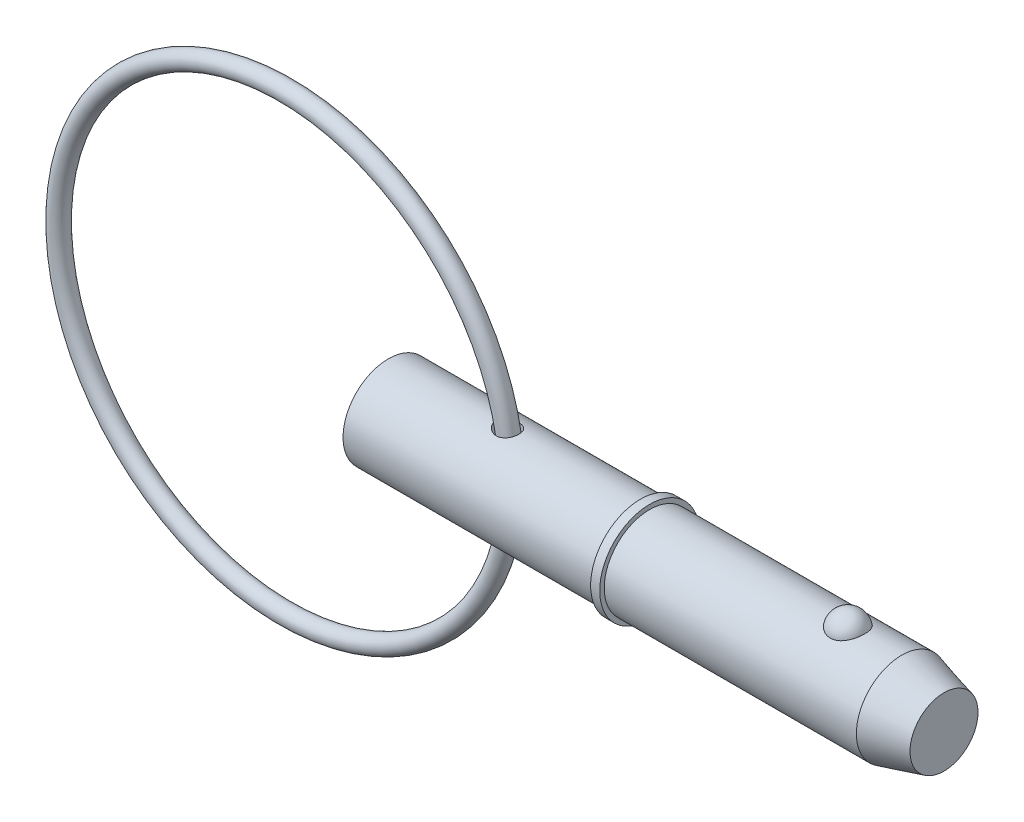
ISO-10303-21;
HEADER;
FILE_DESCRIPTION(('STEP AP214'),'2;1');
FILE_NAME('part.step','',(''),(''),'','','');
FILE_SCHEMA(('AUTOMOTIVE_DESIGN { 1 0 10303 214 1 1 1 1 }'));
ENDSEC;
DATA;
#1=APPLICATION_CONTEXT('core data for automotive mechanical design processes');
#2=APPLICATION_PROTOCOL_DEFINITION('international standard','automotive_design',2000,#1);
#3=PRODUCT_CONTEXT('',#1,'mechanical');
#4=PRODUCT('Part','Part','',(#3));
#5=PRODUCT_RELATED_PRODUCT_CATEGORY('part','',(#4));
#6=PRODUCT_DEFINITION_FORMATION('','',#4);
#7=PRODUCT_DEFINITION_CONTEXT('part definition',#1,'design');
#8=PRODUCT_DEFINITION('design','',#6,#7);
#9=PRODUCT_DEFINITION_SHAPE('','',#8);
#10=(LENGTH_UNIT() NAMED_UNIT(*) SI_UNIT(.MILLI.,.METRE.));
#11=(NAMED_UNIT(*) PLANE_ANGLE_UNIT() SI_UNIT($,.RADIAN.));
#12=(NAMED_UNIT(*) SI_UNIT($,.STERADIAN.) SOLID_ANGLE_UNIT());
#13=UNCERTAINTY_MEASURE_WITH_UNIT(LENGTH_MEASURE(1.E-05),#10,'distance_accuracy_value','');
#14=(GEOMETRIC_REPRESENTATION_CONTEXT(3) GLOBAL_UNCERTAINTY_ASSIGNED_CONTEXT((#13)) GLOBAL_UNIT_ASSIGNED_CONTEXT((#10,
#11,#12)) REPRESENTATION_CONTEXT('',''));
#15=CARTESIAN_POINT('',(0.,0.,0.));
#16=DIRECTION('',(0.,0.,1.));
#17=DIRECTION('',(1.,0.,0.));
#18=AXIS2_PLACEMENT_3D('',#15,#16,#17);
#19=CARTESIAN_POINT('',(-7.21857545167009,0.,0.));
#20=DIRECTION('',(0.,0.,1.));
#21=DIRECTION('',(1.,0.,0.));
#22=AXIS2_PLACEMENT_3D('',#19,#20,#21);
#23=TOROIDAL_SURFACE('',#22,15.875,0.634999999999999);
#24=CARTESIAN_POINT('',(9.29142454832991,0.,0.));
#25=VERTEX_POINT('',#24);
#26=VERTEX_LOOP('',#25);
#27=FACE_BOUND('',#26,.T.);
#28=ADVANCED_FACE('P0_F12',(#27),#23,.T.);
#29=CLOSED_SHELL('',(#28));
#30=MANIFOLD_SOLID_BREP('P0_B1',#29);
#31=CARTESIAN_POINT('',(0.,0.,0.));
#32=DIRECTION('',(1.,0.,0.));
#33=DIRECTION('',(0.,0.,-1.));
#34=AXIS2_PLACEMENT_3D('',#31,#32,#33);
#35=CYLINDRICAL_SURFACE('',#34,3.175);
#36=CARTESIAN_POINT('',(7.61208756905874,3.1556298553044,-0.35017883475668));
#37=CARTESIAN_POINT('',(7.63371620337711,3.15106857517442,-0.391277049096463));
#38=CARTESIAN_POINT('',(7.65900587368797,3.14590738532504,-0.430417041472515));
#39=CARTESIAN_POINT('',(7.71586762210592,3.13499707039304,-0.503788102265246));
#40=CARTESIAN_POINT('',(7.74745045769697,3.12924694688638,-0.538010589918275));
#41=CARTESIAN_POINT('',(7.81573449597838,3.11782384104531,-0.600675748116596));
#42=CARTESIAN_POINT('',(7.85242014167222,3.11215067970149,-0.629135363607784));
#43=CARTESIAN_POINT('',(7.9299616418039,3.10148180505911,-0.679784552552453));
#44=CARTESIAN_POINT('',(7.97081650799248,3.0964859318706,-0.701975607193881));
#45=CARTESIAN_POINT('',(8.05731415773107,3.08756286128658,-0.740259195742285));
#46=CARTESIAN_POINT('',(8.10308043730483,3.08368396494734,-0.756085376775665));
#47=CARTESIAN_POINT('',(8.19675033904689,3.07777545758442,-0.779791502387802));
#48=CARTESIAN_POINT('',(8.24465368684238,3.07574560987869,-0.787672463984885));
#49=CARTESIAN_POINT('',(8.33978659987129,3.07388057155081,-0.794919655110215));
#50=CARTESIAN_POINT('',(8.38699681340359,3.07398484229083,-0.794520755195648));
#51=CARTESIAN_POINT('',(8.48058476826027,3.07628376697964,-0.785572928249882));
#52=CARTESIAN_POINT('',(8.52696281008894,3.07847765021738,-0.777027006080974));
#53=CARTESIAN_POINT('',(8.61487038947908,3.08453758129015,-0.752595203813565));
#54=CARTESIAN_POINT('',(8.65652632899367,3.0883052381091,-0.737137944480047));
#55=CARTESIAN_POINT('',(8.73650065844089,3.09706199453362,-0.69943165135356));
#56=CARTESIAN_POINT('',(8.77481931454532,3.10205099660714,-0.677183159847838));
#57=CARTESIAN_POINT('',(8.84638246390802,3.11258194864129,-0.62697851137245));
#58=CARTESIAN_POINT('',(8.87970556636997,3.11811239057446,-0.599131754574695));
#59=CARTESIAN_POINT('',(8.94123162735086,3.12919300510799,-0.538266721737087));
#60=CARTESIAN_POINT('',(8.96943428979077,3.1347431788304,-0.505248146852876));
#61=CARTESIAN_POINT('',(9.02036334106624,3.14533698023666,-0.434482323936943));
#62=CARTESIAN_POINT('',(9.04301290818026,3.15037299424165,-0.396678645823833));
#63=CARTESIAN_POINT('',(9.08180072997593,3.15931021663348,-0.317742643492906));
#64=CARTESIAN_POINT('',(9.0979387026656,3.1632113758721,-0.27661017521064));
#65=CARTESIAN_POINT('',(9.12343544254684,3.16949230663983,-0.191753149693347));
#66=CARTESIAN_POINT('',(9.13272827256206,3.17185725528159,-0.148007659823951));
#67=CARTESIAN_POINT('',(9.14405176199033,3.17475043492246,-0.0595274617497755));
#68=CARTESIAN_POINT('',(9.14608246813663,3.17527867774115,-0.0147927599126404));
#69=CARTESIAN_POINT('',(9.1428335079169,3.1744420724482,0.0743443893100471));
#70=CARTESIAN_POINT('',(9.13756166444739,3.17307925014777,0.118747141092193));
#71=CARTESIAN_POINT('',(9.11985162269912,3.1686108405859,0.206009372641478));
#72=CARTESIAN_POINT('',(9.10741326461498,3.16550521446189,0.248868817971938));
#73=CARTESIAN_POINT('',(9.07566875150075,3.1578851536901,0.331849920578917));
#74=CARTESIAN_POINT('',(9.05635986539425,3.15337015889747,0.371970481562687));
#75=CARTESIAN_POINT('',(9.01134716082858,3.14342392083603,0.448324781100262));
#76=CARTESIAN_POINT('',(8.98564319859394,3.13799265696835,0.484558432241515));
#77=CARTESIAN_POINT('',(8.92847529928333,3.12681455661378,0.552114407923));
#78=CARTESIAN_POINT('',(8.89701024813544,3.12106765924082,0.583435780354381));
#79=CARTESIAN_POINT('',(8.82914631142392,3.10991074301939,0.640250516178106));
#80=CARTESIAN_POINT('',(8.79274799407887,3.10450068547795,0.665744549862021));
#81=CARTESIAN_POINT('',(8.71647895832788,3.09469918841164,0.709908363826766));
#82=CARTESIAN_POINT('',(8.6766541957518,3.09029650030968,0.728654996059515));
#83=CARTESIAN_POINT('',(8.59431583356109,3.08292493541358,0.759241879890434));
#84=CARTESIAN_POINT('',(8.55180254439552,3.07995589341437,0.771082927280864));
#85=CARTESIAN_POINT('',(8.46578539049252,3.07578939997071,0.787538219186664));
#86=CARTESIAN_POINT('',(8.42229655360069,3.07457372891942,0.792226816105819));
#87=CARTESIAN_POINT('',(8.33511786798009,3.07395008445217,0.794642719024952));
#88=CARTESIAN_POINT('',(8.29142799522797,3.07454233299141,0.792369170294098));
#89=CARTESIAN_POINT('',(8.20393675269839,3.07746038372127,0.7809593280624));
#90=CARTESIAN_POINT('',(8.16015857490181,3.07982804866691,0.771657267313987));
#91=CARTESIAN_POINT('',(8.07467704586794,3.08604667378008,0.746397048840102));
#92=CARTESIAN_POINT('',(8.03297433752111,3.08989809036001,0.730436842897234));
#93=CARTESIAN_POINT('',(7.95039160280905,3.09890222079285,0.691270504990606));
#94=CARTESIAN_POINT('',(7.90968495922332,3.10411517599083,0.667712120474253));
#95=CARTESIAN_POINT('',(7.83271969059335,3.1151281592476,0.614283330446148));
#96=CARTESIAN_POINT('',(7.79646250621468,3.12092837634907,0.584410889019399));
#97=CARTESIAN_POINT('',(7.72857688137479,3.13262084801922,0.518141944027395));
#98=CARTESIAN_POINT('',(7.69709348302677,3.13851156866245,0.481595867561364));
#99=CARTESIAN_POINT('',(7.64110131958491,3.14951669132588,0.403390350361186));
#100=CARTESIAN_POINT('',(7.61658964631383,3.15463141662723,0.361733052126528));
#101=CARTESIAN_POINT('',(7.57680170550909,3.16317869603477,0.276844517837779));
#102=CARTESIAN_POINT('',(7.56109307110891,3.16668805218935,0.233824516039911));
#103=CARTESIAN_POINT('',(7.53774475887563,3.17196948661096,0.145544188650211));
#104=CARTESIAN_POINT('',(7.53010042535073,3.17374256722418,0.100285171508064));
#105=CARTESIAN_POINT('',(7.52361520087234,3.17524561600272,0.0131362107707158));
#106=CARTESIAN_POINT('',(7.52405785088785,3.17514186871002,-0.0286991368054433));
#107=CARTESIAN_POINT('',(7.53198606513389,3.17330730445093,-0.11163297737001));
#108=CARTESIAN_POINT('',(7.53946515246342,3.17157798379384,-0.152732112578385));
#109=CARTESIAN_POINT('',(7.55761776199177,3.16747587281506,-0.220170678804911));
#110=CARTESIAN_POINT('',(7.56650761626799,3.16548510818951,-0.24703103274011));
#111=CARTESIAN_POINT('',(7.58717790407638,3.16094651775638,-0.299561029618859));
#112=CARTESIAN_POINT('',(7.59895820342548,3.15839871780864,-0.325230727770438));
#113=CARTESIAN_POINT('',(7.61208756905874,3.1556298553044,-0.35017883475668));
#114=B_SPLINE_CURVE_WITH_KNOTS('',3,(#36,#37,#38,#39,#40,#41,#42,#43,#44,#45,#46,#47,#48,#49,
#50,#51,#52,#53,#54,#55,#56,#57,#58,#59,#60,#61,#62,#63,#64,#65,#66,#67,#68,#69,#70,#71,#72,#73,
#74,#75,#76,#77,#78,#79,#80,#81,#82,#83,#84,#85,#86,#87,#88,#89,#90,#91,#92,#93,#94,#95,#96,#97,
#98,#99,#100,#101,#102,#103,#104,#105,#106,#107,#108,#109,#110,#111,#112,#113),.UNSPECIFIED.,
.T.,.F.,(4,2,2,2,2,2,2,2,2,2,2,2,2,2,2,2,2,2,2,2,2,2,2,2,2,2,2,2,2,2,2,2,2,2,2,2,2,2,4),(0.,
0.139884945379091,0.280011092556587,0.419719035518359,0.559393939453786,0.704422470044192,
0.849432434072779,0.990334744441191,1.13118510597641,1.26430449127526,1.39741324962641,
1.52813722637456,1.65886875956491,1.79131797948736,1.92377293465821,2.05748767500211,
2.19120155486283,2.32477230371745,2.45834603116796,2.5919729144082,2.72560280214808,
2.8592585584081,2.9928989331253,3.12496502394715,3.25701589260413,3.3876844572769,
3.51836906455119,3.65223598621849,3.78614411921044,3.92746618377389,4.06883388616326,
4.21388116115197,4.35886784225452,4.4959119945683,4.63287698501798,4.75777153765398,
4.88255123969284,4.9674704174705,5.05238565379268),.UNSPECIFIED.);
#115=CARTESIAN_POINT('',(7.61208756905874,3.1556298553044,-0.35017883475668));
#116=VERTEX_POINT('',#115);
#117=EDGE_CURVE('P1_E42',#116,#116,#114,.T.);
#118=ORIENTED_EDGE('',*,*,#117,.T.);
#119=EDGE_LOOP('',(#118));
#120=FACE_BOUND('',#119,.T.);
#121=CARTESIAN_POINT('',(0.,0.,0.));
#122=DIRECTION('',(1.,0.,0.));
#123=DIRECTION('',(0.,0.,-1.));
#124=AXIS2_PLACEMENT_3D('',#121,#122,#123);
#125=CIRCLE('',#124,3.175);
#126=CARTESIAN_POINT('',(0.,0.,-3.175));
#127=VERTEX_POINT('',#126);
#128=EDGE_CURVE('P1_E9',#127,#127,#125,.T.);
#129=ORIENTED_EDGE('',*,*,#128,.T.);
#130=EDGE_LOOP('',(#129));
#131=FACE_BOUND('',#130,.T.);
#132=CARTESIAN_POINT('',(17.655,0.,0.));
#133=DIRECTION('',(1.,0.,0.));
#134=DIRECTION('',(0.,0.,-1.));
#135=AXIS2_PLACEMENT_3D('',#132,#133,#134);
#136=CIRCLE('',#135,3.175);
#137=CARTESIAN_POINT('',(17.655,0.,-3.175));
#138=VERTEX_POINT('',#137);
#139=EDGE_CURVE('P1_E25',#138,#138,#136,.T.);
#140=ORIENTED_EDGE('',*,*,#139,.F.);
#141=EDGE_LOOP('',(#140));
#142=FACE_BOUND('',#141,.T.);
#143=CARTESIAN_POINT('',(7.61208756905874,-3.1556298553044,-0.35017883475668));
#144=CARTESIAN_POINT('',(7.59286963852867,-3.15968249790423,-0.313658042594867));
#145=CARTESIAN_POINT('',(7.57653057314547,-3.16326353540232,-0.275569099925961));
#146=CARTESIAN_POINT('',(7.55026251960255,-3.16911690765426,-0.197144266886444));
#147=CARTESIAN_POINT('',(7.5403309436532,-3.17138977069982,-0.156809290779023));
#148=CARTESIAN_POINT('',(7.52732229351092,-3.17438133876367,-0.0748996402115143));
#149=CARTESIAN_POINT('',(7.52425928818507,-3.17509685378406,-0.0333225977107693));
#150=CARTESIAN_POINT('',(7.52518511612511,-3.17488190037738,0.0497488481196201));
#151=CARTESIAN_POINT('',(7.52917391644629,-3.17395143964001,0.0912432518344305));
#152=CARTESIAN_POINT('',(7.5438119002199,-3.17059494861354,0.171876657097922));
#153=CARTESIAN_POINT('',(7.55428987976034,-3.16820738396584,0.211048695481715));
#154=CARTESIAN_POINT('',(7.58129107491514,-3.16221942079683,0.287144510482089));
#155=CARTESIAN_POINT('',(7.59781536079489,-3.15861880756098,0.324067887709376));
#156=CARTESIAN_POINT('',(7.63709105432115,-3.15038497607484,0.39633030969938));
#157=CARTESIAN_POINT('',(7.66007308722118,-3.14571500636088,0.431539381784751));
#158=CARTESIAN_POINT('',(7.71115516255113,-3.1358897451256,0.497945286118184));
#159=CARTESIAN_POINT('',(7.73925713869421,-3.13073427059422,0.529140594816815));
#160=CARTESIAN_POINT('',(7.80245490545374,-3.11995925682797,0.589491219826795));
#161=CARTESIAN_POINT('',(7.83794667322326,-3.11433841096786,0.618232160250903));
#162=CARTESIAN_POINT('',(7.91311816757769,-3.10367079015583,0.669735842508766));
#163=CARTESIAN_POINT('',(7.9527994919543,-3.09862423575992,0.692496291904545));
#164=CARTESIAN_POINT('',(8.0376108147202,-3.08940933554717,0.732544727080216));
#165=CARTESIAN_POINT('',(8.08291928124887,-3.08530306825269,0.749471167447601));
#166=CARTESIAN_POINT('',(8.17586222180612,-3.07887185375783,0.775470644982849));
#167=CARTESIAN_POINT('',(8.22349631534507,-3.07654661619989,0.784544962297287));
#168=CARTESIAN_POINT('',(8.31855368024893,-3.0740583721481,0.794238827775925));
#169=CARTESIAN_POINT('',(8.365955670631,-3.0738459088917,0.795051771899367));
#170=CARTESIAN_POINT('',(8.46014660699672,-3.07554059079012,0.788471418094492));
#171=CARTESIAN_POINT('',(8.50693577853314,-3.07744693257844,0.781081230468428));
#172=CARTESIAN_POINT('',(8.59580031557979,-3.08301185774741,0.75880456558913));
#173=CARTESIAN_POINT('',(8.63799306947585,-3.0865668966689,0.744358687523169));
#174=CARTESIAN_POINT('',(8.71919510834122,-3.09498125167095,0.708556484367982));
#175=CARTESIAN_POINT('',(8.75820469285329,-3.09984044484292,0.687200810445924));
#176=CARTESIAN_POINT('',(8.83112932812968,-3.11018970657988,0.638704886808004));
#177=CARTESIAN_POINT('',(8.86513521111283,-3.11566412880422,0.6116975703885));
#178=CARTESIAN_POINT('',(8.92814452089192,-3.1267232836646,0.552389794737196));
#179=CARTESIAN_POINT('',(8.95714769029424,-3.13230802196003,0.520089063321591));
#180=CARTESIAN_POINT('',(9.00975680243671,-3.1430519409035,0.450661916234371));
#181=CARTESIAN_POINT('',(9.03329284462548,-3.14820512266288,0.413481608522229));
#182=CARTESIAN_POINT('',(9.07393955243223,-3.15745247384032,0.335639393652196));
#183=CARTESIAN_POINT('',(9.09104990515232,-3.16154659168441,0.294977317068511));
#184=CARTESIAN_POINT('',(9.11857731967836,-3.16827429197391,0.21085639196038));
#185=CARTESIAN_POINT('',(9.12892253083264,-3.1708921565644,0.167372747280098));
#186=CARTESIAN_POINT('',(9.14237674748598,-3.17431758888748,0.0792307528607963));
#187=CARTESIAN_POINT('',(9.14548579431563,-3.17512516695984,0.0345724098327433));
#188=CARTESIAN_POINT('',(9.14439142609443,-3.17484319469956,-0.0546175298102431));
#189=CARTESIAN_POINT('',(9.14019308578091,-3.17375496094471,-0.0991491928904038));
#190=CARTESIAN_POINT('',(9.12459742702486,-3.16980106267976,-0.186852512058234));
#191=CARTESIAN_POINT('',(9.11319997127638,-3.16693536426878,-0.230024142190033));
#192=CARTESIAN_POINT('',(9.08348483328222,-3.15973571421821,-0.313789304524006));
#193=CARTESIAN_POINT('',(9.06516665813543,-3.15540165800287,-0.354382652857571));
#194=CARTESIAN_POINT('',(9.02205745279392,-3.14573679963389,-0.431845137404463));
#195=CARTESIAN_POINT('',(8.99726624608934,-3.14040597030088,-0.468714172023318));
#196=CARTESIAN_POINT('',(8.94180687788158,-3.12933254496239,-0.53770470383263));
#197=CARTESIAN_POINT('',(8.91113471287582,-3.12358967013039,-0.569822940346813));
#198=CARTESIAN_POINT('',(8.84472020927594,-3.11234460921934,-0.628352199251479));
#199=CARTESIAN_POINT('',(8.80897839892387,-3.10684239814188,-0.654763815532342));
#200=CARTESIAN_POINT('',(8.73381844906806,-3.0967672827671,-0.700864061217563));
#201=CARTESIAN_POINT('',(8.69444454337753,-3.09218491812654,-0.720622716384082));
#202=CARTESIAN_POINT('',(8.61282389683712,-3.08439406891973,-0.75327416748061));
#203=CARTESIAN_POINT('',(8.57057751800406,-3.08118541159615,-0.766167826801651));
#204=CARTESIAN_POINT('',(8.48495851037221,-3.07651651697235,-0.784705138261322));
#205=CARTESIAN_POINT('',(8.44160497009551,-3.07503616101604,-0.7904322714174));
#206=CARTESIAN_POINT('',(8.35452054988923,-3.07388232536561,-0.794907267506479));
#207=CARTESIAN_POINT('',(8.31078963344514,-3.07420902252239,-0.793654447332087));
#208=CARTESIAN_POINT('',(8.22319164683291,-3.07661365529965,-0.784281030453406));
#209=CARTESIAN_POINT('',(8.17934121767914,-3.07872844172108,-0.776015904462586));
#210=CARTESIAN_POINT('',(8.09354825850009,-3.08448489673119,-0.752807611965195));
#211=CARTESIAN_POINT('',(8.05160636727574,-3.08812707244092,-0.737862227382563));
#212=CARTESIAN_POINT('',(7.9683964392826,-3.09676294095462,-0.700760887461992));
#213=CARTESIAN_POINT('',(7.92729071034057,-3.10181965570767,-0.678255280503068));
#214=CARTESIAN_POINT('',(7.84934481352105,-3.11260576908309,-0.626894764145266));
#215=CARTESIAN_POINT('',(7.81250545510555,-3.11833529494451,-0.598038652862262));
#216=CARTESIAN_POINT('',(7.74486652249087,-3.12971026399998,-0.535287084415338));
#217=CARTESIAN_POINT('',(7.71395414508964,-3.13535486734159,-0.50151327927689));
#218=CARTESIAN_POINT('',(7.65821444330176,-3.14606907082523,-0.429192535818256));
#219=CARTESIAN_POINT('',(7.63338346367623,-3.15113901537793,-0.390648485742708));
#220=CARTESIAN_POINT('',(7.61208756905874,-3.1556298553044,-0.35017883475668));
#221=B_SPLINE_CURVE_WITH_KNOTS('',3,(#143,#144,#145,#146,#147,#148,#149,#150,#151,#152,#153,
#154,#155,#156,#157,#158,#159,#160,#161,#162,#163,#164,#165,#166,#167,#168,#169,#170,#171,#172,
#173,#174,#175,#176,#177,#178,#179,#180,#181,#182,#183,#184,#185,#186,#187,#188,#189,#190,#191,
#192,#193,#194,#195,#196,#197,#198,#199,#200,#201,#202,#203,#204,#205,#206,#207,#208,#209,#210,
#211,#212,#213,#214,#215,#216,#217,#218,#219,#220),.UNSPECIFIED.,.T.,.F.,(4,2,2,2,2,2,2,2,2,2,2,
2,2,2,2,2,2,2,2,2,2,2,2,2,2,2,2,2,2,2,2,2,2,2,2,2,2,2,4),(0.,0.124257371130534,0.24846452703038,
0.372925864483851,0.497386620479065,0.618695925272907,0.740026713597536,0.86640919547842,
0.992839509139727,1.13028244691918,1.26777799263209,1.41269245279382,1.55758328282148,
1.69907422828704,1.84051154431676,1.97406862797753,2.10761312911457,2.23831247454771,
2.36901854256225,2.5013136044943,2.63361510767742,2.76729986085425,2.90098385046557,
3.03457503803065,3.16816877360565,3.3017720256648,3.43537892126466,3.56907709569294,
3.70276134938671,3.83499098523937,3.96720398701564,4.09786208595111,4.22853297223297,
4.36196440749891,4.49544017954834,4.63621591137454,4.77701830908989,4.91479418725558,
5.05248705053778),.UNSPECIFIED.);
#222=CARTESIAN_POINT('',(7.61208756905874,-3.1556298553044,-0.35017883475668));
#223=VERTEX_POINT('',#222);
#224=EDGE_CURVE('P1_E17',#223,#223,#221,.T.);
#225=ORIENTED_EDGE('',*,*,#224,.T.);
#226=EDGE_LOOP('',(#225));
#227=FACE_BOUND('',#226,.T.);
#228=ADVANCED_FACE('P1_F13',(#120,#131,#142,#227),#35,.T.);
#229=CARTESIAN_POINT('',(0.,0.,0.));
#230=DIRECTION('',(1.,0.,0.));
#231=DIRECTION('',(0.,0.,-1.));
#232=AXIS2_PLACEMENT_3D('',#229,#230,#231);
#233=CYLINDRICAL_SURFACE('',#232,3.175);
#234=CARTESIAN_POINT('',(35.9476846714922,0.,0.));
#235=DIRECTION('',(1.,0.,0.));
#236=DIRECTION('',(0.,0.,-1.));
#237=AXIS2_PLACEMENT_3D('',#234,#235,#236);
#238=CIRCLE('',#237,3.175);
#239=CARTESIAN_POINT('',(35.9476846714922,0.,-3.175));
#240=VERTEX_POINT('',#239);
#241=EDGE_CURVE('P1_E99',#240,#240,#238,.T.);
#242=ORIENTED_EDGE('',*,*,#241,.F.);
#243=EDGE_LOOP('',(#242));
#244=FACE_BOUND('',#243,.T.);
#245=CARTESIAN_POINT('',(18.29,0.,0.));
#246=DIRECTION('',(1.,0.,0.));
#247=DIRECTION('',(0.,0.,-1.));
#248=AXIS2_PLACEMENT_3D('',#245,#246,#247);
#249=CIRCLE('',#248,3.175);
#250=CARTESIAN_POINT('',(18.29,0.,-3.175));
#251=VERTEX_POINT('',#250);
#252=EDGE_CURVE('P1_E96',#251,#251,#249,.T.);
#253=ORIENTED_EDGE('',*,*,#252,.T.);
#254=EDGE_LOOP('',(#253));
#255=FACE_BOUND('',#254,.T.);
#256=CARTESIAN_POINT('',(32.1757276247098,2.92898950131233,1.22541646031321));
#257=CARTESIAN_POINT('',(32.112316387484,2.92899434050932,1.22541146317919));
#258=CARTESIAN_POINT('',(32.0487979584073,2.93112688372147,1.2203464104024));
#259=CARTESIAN_POINT('',(31.9235306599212,2.93942752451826,1.20020949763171));
#260=CARTESIAN_POINT('',(31.8617869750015,2.9456063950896,1.18511092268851));
#261=CARTESIAN_POINT('',(31.7420651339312,2.96127115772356,1.14540352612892));
#262=CARTESIAN_POINT('',(31.6840775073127,2.97074831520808,1.12081980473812));
#263=CARTESIAN_POINT('',(31.5731943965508,2.99197584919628,1.06285154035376));
#264=CARTESIAN_POINT('',(31.5202966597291,3.00372521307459,1.0294709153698));
#265=CARTESIAN_POINT('',(31.4192688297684,3.02865714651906,0.953674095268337));
#266=CARTESIAN_POINT('',(31.371324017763,3.04187163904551,0.911021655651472));
#267=CARTESIAN_POINT('',(31.2830360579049,3.06808741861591,0.818400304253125));
#268=CARTESIAN_POINT('',(31.2426952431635,3.08108863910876,0.768429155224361));
#269=CARTESIAN_POINT('',(31.1688039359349,3.10614903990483,0.660064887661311));
#270=CARTESIAN_POINT('',(31.1356330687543,3.11814104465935,0.601396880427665));
#271=CARTESIAN_POINT('',(31.0791190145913,3.13926931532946,0.479026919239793));
#272=CARTESIAN_POINT('',(31.0557764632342,3.14840539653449,0.415324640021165));
#273=CARTESIAN_POINT('',(31.0191785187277,3.16298160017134,0.283885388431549));
#274=CARTESIAN_POINT('',(31.0060407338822,3.16837855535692,0.21611080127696));
#275=CARTESIAN_POINT('',(30.9905676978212,3.17475386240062,0.0791367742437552));
#276=CARTESIAN_POINT('',(30.988232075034,3.17573236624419,0.00993738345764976));
#277=CARTESIAN_POINT('',(30.994388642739,3.17318075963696,-0.127420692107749));
#278=CARTESIAN_POINT('',(31.0028073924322,3.16968122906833,-0.195583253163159));
#279=CARTESIAN_POINT('',(31.0301752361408,3.1585790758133,-0.329413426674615));
#280=CARTESIAN_POINT('',(31.0491245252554,3.15097637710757,-0.395080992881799));
#281=CARTESIAN_POINT('',(31.0972057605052,3.13242485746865,-0.522180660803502));
#282=CARTESIAN_POINT('',(31.1263524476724,3.12147119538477,-0.583606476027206));
#283=CARTESIAN_POINT('',(31.1942352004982,3.09734973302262,-0.700436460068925));
#284=CARTESIAN_POINT('',(31.232972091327,3.08418174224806,-0.7558401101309));
#285=CARTESIAN_POINT('',(31.3194771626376,3.05694884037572,-0.859404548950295));
#286=CARTESIAN_POINT('',(31.3672961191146,3.04287919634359,-0.907521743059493));
#287=CARTESIAN_POINT('',(31.4707353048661,3.01548927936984,-0.994758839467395));
#288=CARTESIAN_POINT('',(31.5263549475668,3.00216895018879,-1.03387941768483));
#289=CARTESIAN_POINT('',(31.6428093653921,2.97810316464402,-1.10126594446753));
#290=CARTESIAN_POINT('',(31.7035182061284,2.96731170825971,-1.12973256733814));
#291=CARTESIAN_POINT('',(31.8293712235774,2.9492893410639,-1.17598467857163));
#292=CARTESIAN_POINT('',(31.8945137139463,2.94205708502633,-1.19377420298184));
#293=CARTESIAN_POINT('',(32.0238562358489,2.93233065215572,-1.21746387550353));
#294=CARTESIAN_POINT('',(32.0879385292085,2.92961621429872,-1.22391763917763));
#295=CARTESIAN_POINT('',(32.2163375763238,2.92855752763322,-1.22644976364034));
#296=CARTESIAN_POINT('',(32.280654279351,2.9302123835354,-1.22253024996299));
#297=CARTESIAN_POINT('',(32.4055239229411,2.9375685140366,-1.20474140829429));
#298=CARTESIAN_POINT('',(32.466131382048,2.94313790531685,-1.19119621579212));
#299=CARTESIAN_POINT('',(32.5841106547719,2.95756226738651,-1.15491492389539));
#300=CARTESIAN_POINT('',(32.6414822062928,2.9664175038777,-1.13217808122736));
#301=CARTESIAN_POINT('',(32.7527699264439,2.98669918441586,-1.07755083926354));
#302=CARTESIAN_POINT('',(32.8065845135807,2.9981771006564,-1.0454730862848));
#303=CARTESIAN_POINT('',(32.9081473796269,3.02240235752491,-0.973220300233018));
#304=CARTESIAN_POINT('',(32.9558942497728,3.03514999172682,-0.933043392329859));
#305=CARTESIAN_POINT('',(33.0465817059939,3.06131230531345,-0.843372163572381));
#306=CARTESIAN_POINT('',(33.0891588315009,3.07472822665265,-0.793510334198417));
#307=CARTESIAN_POINT('',(33.1656765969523,3.10021106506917,-0.687241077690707));
#308=CARTESIAN_POINT('',(33.1996156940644,3.1122777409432,-0.630832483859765));
#309=CARTESIAN_POINT('',(33.2591209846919,3.134208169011,-0.511059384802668));
#310=CARTESIAN_POINT('',(33.2843892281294,3.14399040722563,-0.447531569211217));
#311=CARTESIAN_POINT('',(33.3245117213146,3.15983820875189,-0.316827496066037));
#312=CARTESIAN_POINT('',(33.3393659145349,3.16590375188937,-0.249651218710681));
#313=CARTESIAN_POINT('',(33.358358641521,3.17370076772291,-0.113549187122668));
#314=CARTESIAN_POINT('',(33.3624966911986,3.17543204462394,-0.0446233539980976));
#315=CARTESIAN_POINT('',(33.3599697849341,3.17438372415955,0.0929938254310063));
#316=CARTESIAN_POINT('',(33.3533050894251,3.17160423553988,0.161685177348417));
#317=CARTESIAN_POINT('',(33.3293754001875,3.1618438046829,0.296502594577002));
#318=CARTESIAN_POINT('',(33.3121674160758,3.15488546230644,0.362640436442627));
#319=CARTESIAN_POINT('',(33.267547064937,3.13748892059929,0.490896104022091));
#320=CARTESIAN_POINT('',(33.2401339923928,3.12705048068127,0.553013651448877));
#321=CARTESIAN_POINT('',(33.1754626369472,3.10369139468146,0.671876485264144));
#322=CARTESIAN_POINT('',(33.1381467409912,3.0907563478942,0.728587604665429));
#323=CARTESIAN_POINT('',(33.0545246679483,3.06381731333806,0.834653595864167));
#324=CARTESIAN_POINT('',(33.0082189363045,3.04981337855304,0.884008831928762));
#325=CARTESIAN_POINT('',(32.9077184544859,3.02230423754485,0.973916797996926));
#326=CARTESIAN_POINT('',(32.853535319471,3.00879833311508,1.01448227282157));
#327=CARTESIAN_POINT('',(32.7385299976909,2.98383625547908,1.0857155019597));
#328=CARTESIAN_POINT('',(32.6777053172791,2.9723808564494,1.11637952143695));
#329=CARTESIAN_POINT('',(32.5533690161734,2.95329063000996,1.16592590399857));
#330=CARTESIAN_POINT('',(32.4900230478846,2.9455373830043,1.18517901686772));
#331=CARTESIAN_POINT('',(32.3607664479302,2.9342556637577,1.21284802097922));
#332=CARTESIAN_POINT('',(32.2948641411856,2.93071450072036,1.22129647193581));
#333=CARTESIAN_POINT('',(32.211116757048,2.92915255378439,1.22502505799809));
#334=CARTESIAN_POINT('',(32.1934263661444,2.92898815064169,1.22541785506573));
#335=CARTESIAN_POINT('',(32.1757276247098,2.92898950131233,1.22541646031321));
#336=B_SPLINE_CURVE_WITH_KNOTS('',3,(#256,#257,#258,#259,#260,#261,#262,#263,#264,#265,#266,
#267,#268,#269,#270,#271,#272,#273,#274,#275,#276,#277,#278,#279,#280,#281,#282,#283,#284,#285,
#286,#287,#288,#289,#290,#291,#292,#293,#294,#295,#296,#297,#298,#299,#300,#301,#302,#303,#304,
#305,#306,#307,#308,#309,#310,#311,#312,#313,#314,#315,#316,#317,#318,#319,#320,#321,#322,#323,
#324,#325,#326,#327,#328,#329,#330,#331,#332,#333,#334,#335),.UNSPECIFIED.,.T.,.F.,(4,2,2,2,2,2,
2,2,2,2,2,2,2,2,2,2,2,2,2,2,2,2,2,2,2,2,2,2,2,2,2,2,2,2,2,2,2,2,2,4),(0.,0.190186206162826,
0.380880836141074,0.571074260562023,0.761183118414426,0.956866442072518,1.15260970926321,
1.35701770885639,1.56143892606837,1.76818248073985,1.97491892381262,2.18025109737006,
2.38558707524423,2.59122111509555,2.79687285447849,3.00371012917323,3.21053185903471,
3.41323429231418,3.61586005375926,3.80828192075,4.00066436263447,4.18685798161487,
4.37306665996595,4.56330302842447,4.75358348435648,4.95345287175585,5.15335793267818,
5.35957003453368,5.56578325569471,5.77200579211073,5.97822335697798,6.18333558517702,
6.38846199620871,6.59480900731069,6.8011457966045,7.00718137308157,7.21329457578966,
7.41228022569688,7.61066481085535,7.66374777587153),.UNSPECIFIED.);
#337=CARTESIAN_POINT('',(32.1757276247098,2.92898950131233,1.22541646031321));
#338=VERTEX_POINT('',#337);
#339=EDGE_CURVE('P1_E34',#338,#338,#336,.T.);
#340=ORIENTED_EDGE('',*,*,#339,.T.);
#341=EDGE_LOOP('',(#340));
#342=FACE_BOUND('',#341,.T.);
#343=ADVANCED_FACE('P1_F46',(#244,#255,#342),#233,.T.);
#344=CARTESIAN_POINT('',(0.,0.,0.));
#345=DIRECTION('',(-1.,0.,0.));
#346=DIRECTION('',(0.,0.,1.));
#347=AXIS2_PLACEMENT_3D('',#344,#345,#346);
#348=PLANE('',#347);
#349=ORIENTED_EDGE('',*,*,#128,.F.);
#350=EDGE_LOOP('',(#349));
#351=FACE_BOUND('',#350,.T.);
#352=ADVANCED_FACE('P1_F15',(#351),#348,.T.);
#353=CARTESIAN_POINT('',(17.655,3.175,0.));
#354=DIRECTION('',(-1.,0.,0.));
#355=DIRECTION('',(0.,0.,1.));
#356=AXIS2_PLACEMENT_3D('',#353,#354,#355);
#357=PLANE('',#356);
#358=ORIENTED_EDGE('',*,*,#139,.T.);
#359=EDGE_LOOP('',(#358));
#360=FACE_BOUND('',#359,.T.);
#361=CARTESIAN_POINT('',(17.655,0.,0.));
#362=DIRECTION('',(1.,0.,0.));
#363=DIRECTION('',(0.,0.,-1.));
#364=AXIS2_PLACEMENT_3D('',#361,#362,#363);
#365=CIRCLE('',#364,3.4925);
#366=CARTESIAN_POINT('',(17.655,0.,-3.4925));
#367=VERTEX_POINT('',#366);
#368=EDGE_CURVE('P1_E30',#367,#367,#365,.T.);
#369=ORIENTED_EDGE('',*,*,#368,.F.);
#370=EDGE_LOOP('',(#369));
#371=FACE_BOUND('',#370,.T.);
#372=ADVANCED_FACE('P1_F81',(#360,#371),#357,.T.);
#373=CARTESIAN_POINT('',(0.,0.,0.));
#374=DIRECTION('',(1.,0.,0.));
#375=DIRECTION('',(0.,0.,-1.));
#376=AXIS2_PLACEMENT_3D('',#373,#374,#375);
#377=CYLINDRICAL_SURFACE('',#376,3.4925);
#378=ORIENTED_EDGE('',*,*,#368,.T.);
#379=EDGE_LOOP('',(#378));
#380=FACE_BOUND('',#379,.T.);
#381=CARTESIAN_POINT('',(18.29,0.,0.));
#382=DIRECTION('',(1.,0.,0.));
#383=DIRECTION('',(0.,0.,-1.));
#384=AXIS2_PLACEMENT_3D('',#381,#382,#383);
#385=CIRCLE('',#384,3.4925);
#386=CARTESIAN_POINT('',(18.29,0.,-3.4925));
#387=VERTEX_POINT('',#386);
#388=EDGE_CURVE('P1_E95',#387,#387,#385,.T.);
#389=ORIENTED_EDGE('',*,*,#388,.F.);
#390=EDGE_LOOP('',(#389));
#391=FACE_BOUND('',#390,.T.);
#392=ADVANCED_FACE('P1_F68',(#380,#391),#377,.T.);
#393=CARTESIAN_POINT('',(18.29,3.4925,0.));
#394=DIRECTION('',(1.,0.,0.));
#395=DIRECTION('',(0.,0.,-1.));
#396=AXIS2_PLACEMENT_3D('',#393,#394,#395);
#397=PLANE('',#396);
#398=ORIENTED_EDGE('',*,*,#388,.T.);
#399=EDGE_LOOP('',(#398));
#400=FACE_BOUND('',#399,.T.);
#401=ORIENTED_EDGE('',*,*,#252,.F.);
#402=EDGE_LOOP('',(#401));
#403=FACE_BOUND('',#402,.T.);
#404=ADVANCED_FACE('P1_F62',(#400,#403),#397,.T.);
#405=CARTESIAN_POINT('',(38.91,0.,0.));
#406=DIRECTION('',(-1.,0.,0.));
#407=DIRECTION('',(0.,0.,1.));
#408=AXIS2_PLACEMENT_3D('',#405,#406,#407);
#409=CONICAL_SURFACE('',#408,2.38125,0.26179938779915);
#410=ORIENTED_EDGE('',*,*,#241,.T.);
#411=EDGE_LOOP('',(#410));
#412=FACE_BOUND('',#411,.T.);
#413=CARTESIAN_POINT('',(38.91,0.,0.));
#414=DIRECTION('',(1.,0.,0.));
#415=DIRECTION('',(0.,0.,-1.));
#416=AXIS2_PLACEMENT_3D('',#413,#414,#415);
#417=CIRCLE('',#416,2.38125);
#418=CARTESIAN_POINT('',(38.91,0.,-2.38125));
#419=VERTEX_POINT('',#418);
#420=EDGE_CURVE('P1_E41',#419,#419,#417,.T.);
#421=ORIENTED_EDGE('',*,*,#420,.F.);
#422=EDGE_LOOP('',(#421));
#423=FACE_BOUND('',#422,.T.);
#424=ADVANCED_FACE('P1_F59',(#412,#423),#409,.T.);
#425=CARTESIAN_POINT('',(38.91,2.38125,0.));
#426=DIRECTION('',(1.,0.,0.));
#427=DIRECTION('',(0.,0.,-1.));
#428=AXIS2_PLACEMENT_3D('',#425,#426,#427);
#429=PLANE('',#428);
#430=ORIENTED_EDGE('',*,*,#420,.T.);
#431=EDGE_LOOP('',(#430));
#432=FACE_BOUND('',#431,.T.);
#433=ADVANCED_FACE('P1_F55',(#432),#429,.T.);
#434=CARTESIAN_POINT('',(32.1757276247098,2.85749999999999,0.));
#435=DIRECTION('',(-1.,0.,0.));
#436=DIRECTION('',(0.,1.,0.));
#437=AXIS2_PLACEMENT_3D('',#434,#435,#436);
#438=SPHERICAL_SURFACE('',#437,1.22750000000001);
#439=ORIENTED_EDGE('',*,*,#339,.F.);
#440=EDGE_LOOP('',(#439));
#441=FACE_BOUND('',#440,.T.);
#442=ADVANCED_FACE('P1_F50',(#441),#438,.T.);
#443=CARTESIAN_POINT('',(-7.21857545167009,0.,0.));
#444=DIRECTION('',(0.,0.,1.));
#445=DIRECTION('',(1.,0.,0.));
#446=AXIS2_PLACEMENT_3D('',#443,#444,#445);
#447=TOROIDAL_SURFACE('',#446,15.875,0.793749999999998);
#448=ORIENTED_EDGE('',*,*,#224,.F.);
#449=EDGE_LOOP('',(#448));
#450=FACE_BOUND('',#449,.T.);
#451=ORIENTED_EDGE('',*,*,#117,.F.);
#452=EDGE_LOOP('',(#451));
#453=FACE_BOUND('',#452,.T.);
#454=ADVANCED_FACE('P1_F54',(#450,#453),#447,.F.);
#455=CLOSED_SHELL('',(#228,#343,#352,#372,#392,#404,#424,#433,#442,#454));
#456=MANIFOLD_SOLID_BREP('P1_B1',#455);
#457=ADVANCED_BREP_SHAPE_REPRESENTATION('',(#18,#30,#456),#14);
#458=SHAPE_DEFINITION_REPRESENTATION(#9,#457);
ENDSEC;
END-ISO-10303-21;
